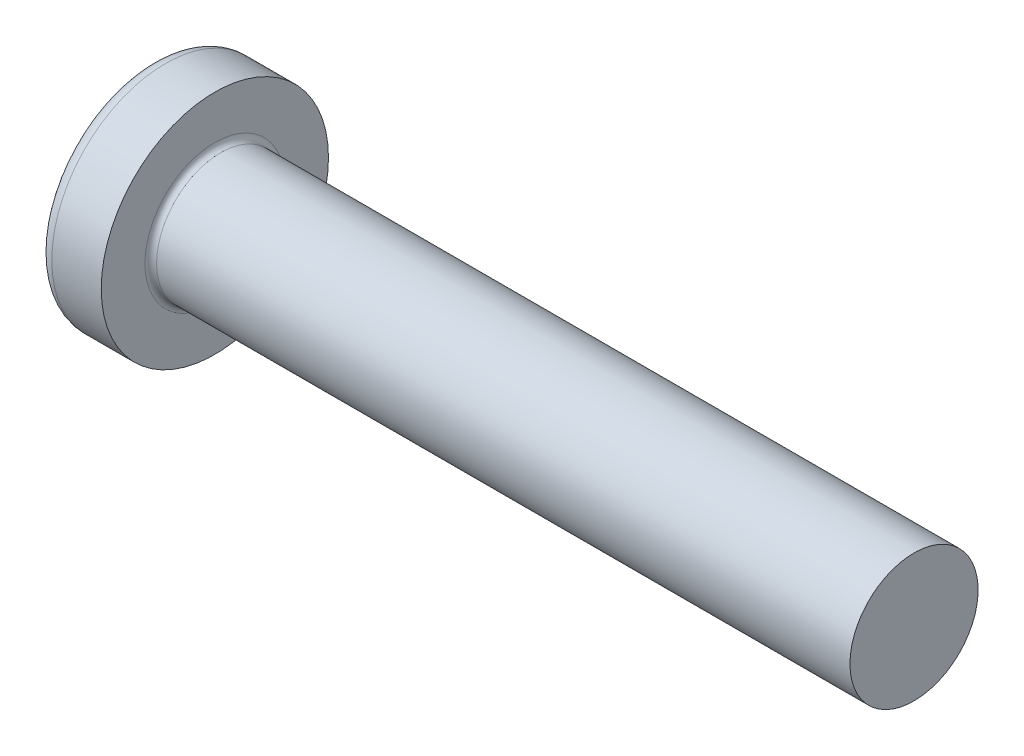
ISO-10303-21;
HEADER;
FILE_DESCRIPTION(('STEP AP214'),'2;1');
FILE_NAME('part.step','',(''),(''),'','','');
FILE_SCHEMA(('AUTOMOTIVE_DESIGN { 1 0 10303 214 1 1 1 1 }'));
ENDSEC;
DATA;
#1=APPLICATION_CONTEXT('core data for automotive mechanical design processes');
#2=APPLICATION_PROTOCOL_DEFINITION('international standard','automotive_design',2000,#1);
#3=PRODUCT_CONTEXT('',#1,'mechanical');
#4=PRODUCT('Part','Part','',(#3));
#5=PRODUCT_RELATED_PRODUCT_CATEGORY('part','',(#4));
#6=PRODUCT_DEFINITION_FORMATION('','',#4);
#7=PRODUCT_DEFINITION_CONTEXT('part definition',#1,'design');
#8=PRODUCT_DEFINITION('design','',#6,#7);
#9=PRODUCT_DEFINITION_SHAPE('','',#8);
#10=(LENGTH_UNIT() NAMED_UNIT(*) SI_UNIT(.MILLI.,.METRE.));
#11=(NAMED_UNIT(*) PLANE_ANGLE_UNIT() SI_UNIT($,.RADIAN.));
#12=(NAMED_UNIT(*) SI_UNIT($,.STERADIAN.) SOLID_ANGLE_UNIT());
#13=UNCERTAINTY_MEASURE_WITH_UNIT(LENGTH_MEASURE(1.E-05),#10,'distance_accuracy_value','');
#14=(GEOMETRIC_REPRESENTATION_CONTEXT(3) GLOBAL_UNCERTAINTY_ASSIGNED_CONTEXT((#13)) GLOBAL_UNIT_ASSIGNED_CONTEXT((#10,
#11,#12)) REPRESENTATION_CONTEXT('',''));
#15=CARTESIAN_POINT('',(0.,0.,0.));
#16=DIRECTION('',(0.,0.,1.));
#17=DIRECTION('',(1.,0.,0.));
#18=AXIS2_PLACEMENT_3D('',#15,#16,#17);
#19=CARTESIAN_POINT('',(1.2,0.601702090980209,-0.3));
#20=DIRECTION('',(-1.,0.,0.));
#21=DIRECTION('',(0.,0.,1.));
#22=AXIS2_PLACEMENT_3D('',#19,#20,#21);
#23=PLANE('',#22);
#24=DIRECTION('',(0.,0.,-1.));
#25=VECTOR('',#24,1.);
#26=CARTESIAN_POINT('',(1.2,0.299999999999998,0.60170209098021));
#27=LINE('',#26,#25);
#28=CARTESIAN_POINT('',(1.2,0.300000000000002,-0.601702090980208));
#29=VERTEX_POINT('',#28);
#30=CARTESIAN_POINT('',(1.19999999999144,0.300000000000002,-0.468119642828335));
#31=VERTEX_POINT('',#30);
#32=EDGE_CURVE('E269',#29,#31,#27,.F.);
#33=ORIENTED_EDGE('',*,*,#32,.F.);
#34=DIRECTION('',(0.,1.,0.));
#35=VECTOR('',#34,1.);
#36=CARTESIAN_POINT('',(1.2,0.300000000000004,-0.601702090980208));
#37=LINE('',#36,#35);
#38=CARTESIAN_POINT('',(1.2,-0.299999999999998,-0.60170209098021));
#39=VERTEX_POINT('',#38);
#40=EDGE_CURVE('E274',#29,#39,#37,.F.);
#41=ORIENTED_EDGE('',*,*,#40,.T.);
#42=DIRECTION('',(0.,0.,1.));
#43=VECTOR('',#42,1.);
#44=CARTESIAN_POINT('',(1.2,-0.299999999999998,-0.601702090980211));
#45=LINE('',#44,#43);
#46=CARTESIAN_POINT('',(1.19999999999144,-0.299999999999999,-0.468119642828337));
#47=VERTEX_POINT('',#46);
#48=EDGE_CURVE('E321',#47,#39,#45,.F.);
#49=ORIENTED_EDGE('',*,*,#48,.F.);
#50=CARTESIAN_POINT('',(1.19999999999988,0.,0.));
#51=DIRECTION('',(-1.,0.,0.));
#52=DIRECTION('',(0.,0.,1.));
#53=AXIS2_PLACEMENT_3D('',#50,#51,#52);
#54=CIRCLE('',#53,0.556000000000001);
#55=EDGE_CURVE('E543',#47,#31,#54,.F.);
#56=ORIENTED_EDGE('',*,*,#55,.T.);
#57=EDGE_LOOP('',(#33,#41,#49,#56));
#58=FACE_BOUND('',#57,.T.);
#59=ADVANCED_FACE('F16',(#58),#23,.T.);
#60=CARTESIAN_POINT('',(1.2,0.601702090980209,-0.3));
#61=DIRECTION('',(-1.,0.,0.));
#62=DIRECTION('',(0.,0.,1.));
#63=AXIS2_PLACEMENT_3D('',#60,#61,#62);
#64=PLANE('',#63);
#65=DIRECTION('',(0.,1.,0.));
#66=VECTOR('',#65,1.);
#67=CARTESIAN_POINT('',(1.2,-0.60170209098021,0.3));
#68=LINE('',#67,#66);
#69=CARTESIAN_POINT('',(1.2,0.601702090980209,0.3));
#70=VERTEX_POINT('',#69);
#71=CARTESIAN_POINT('',(1.19999999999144,0.468119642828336,0.3));
#72=VERTEX_POINT('',#71);
#73=EDGE_CURVE('E139',#70,#72,#68,.F.);
#74=ORIENTED_EDGE('',*,*,#73,.F.);
#75=DIRECTION('',(0.,0.,1.));
#76=VECTOR('',#75,1.);
#77=CARTESIAN_POINT('',(1.2,0.601702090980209,0.3));
#78=LINE('',#77,#76);
#79=CARTESIAN_POINT('',(1.2,0.601702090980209,-0.3));
#80=VERTEX_POINT('',#79);
#81=EDGE_CURVE('E262',#70,#80,#78,.F.);
#82=ORIENTED_EDGE('',*,*,#81,.T.);
#83=DIRECTION('',(0.,1.,0.));
#84=VECTOR('',#83,1.);
#85=CARTESIAN_POINT('',(1.2,0.601702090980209,-0.3));
#86=LINE('',#85,#84);
#87=CARTESIAN_POINT('',(1.19999999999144,0.468119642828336,-0.3));
#88=VERTEX_POINT('',#87);
#89=EDGE_CURVE('E142',#88,#80,#86,.T.);
#90=ORIENTED_EDGE('',*,*,#89,.F.);
#91=CARTESIAN_POINT('',(1.19999999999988,0.,0.));
#92=DIRECTION('',(-1.,0.,0.));
#93=DIRECTION('',(0.,0.,1.));
#94=AXIS2_PLACEMENT_3D('',#91,#92,#93);
#95=CIRCLE('',#94,0.556000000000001);
#96=EDGE_CURVE('E136',#88,#72,#95,.F.);
#97=ORIENTED_EDGE('',*,*,#96,.T.);
#98=EDGE_LOOP('',(#74,#82,#90,#97));
#99=FACE_BOUND('',#98,.T.);
#100=ADVANCED_FACE('F138',(#99),#64,.T.);
#101=CARTESIAN_POINT('',(1.2,0.601702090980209,-0.3));
#102=DIRECTION('',(-1.,0.,0.));
#103=DIRECTION('',(0.,0.,1.));
#104=AXIS2_PLACEMENT_3D('',#101,#102,#103);
#105=PLANE('',#104);
#106=DIRECTION('',(0.,0.,1.));
#107=VECTOR('',#106,1.);
#108=CARTESIAN_POINT('',(1.2,-0.299999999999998,-0.601702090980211));
#109=LINE('',#108,#107);
#110=CARTESIAN_POINT('',(1.2,-0.300000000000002,0.601702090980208));
#111=VERTEX_POINT('',#110);
#112=CARTESIAN_POINT('',(1.19999999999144,-0.300000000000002,0.468119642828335));
#113=VERTEX_POINT('',#112);
#114=EDGE_CURVE('E250',#111,#113,#109,.F.);
#115=ORIENTED_EDGE('',*,*,#114,.F.);
#116=DIRECTION('',(0.,1.,0.));
#117=VECTOR('',#116,1.);
#118=CARTESIAN_POINT('',(1.2,-0.300000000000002,0.601702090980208));
#119=LINE('',#118,#117);
#120=CARTESIAN_POINT('',(1.2,0.299999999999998,0.60170209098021));
#121=VERTEX_POINT('',#120);
#122=EDGE_CURVE('E255',#111,#121,#119,.T.);
#123=ORIENTED_EDGE('',*,*,#122,.T.);
#124=DIRECTION('',(0.,0.,-1.));
#125=VECTOR('',#124,1.);
#126=CARTESIAN_POINT('',(1.2,0.299999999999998,0.60170209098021));
#127=LINE('',#126,#125);
#128=CARTESIAN_POINT('',(1.19999999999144,0.299999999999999,0.468119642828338));
#129=VERTEX_POINT('',#128);
#130=EDGE_CURVE('E299',#129,#121,#127,.F.);
#131=ORIENTED_EDGE('',*,*,#130,.F.);
#132=CARTESIAN_POINT('',(1.19999999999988,0.,0.));
#133=DIRECTION('',(-1.,0.,0.));
#134=DIRECTION('',(0.,0.,1.));
#135=AXIS2_PLACEMENT_3D('',#132,#133,#134);
#136=CIRCLE('',#135,0.556000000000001);
#137=EDGE_CURVE('E148',#129,#113,#136,.F.);
#138=ORIENTED_EDGE('',*,*,#137,.T.);
#139=EDGE_LOOP('',(#115,#123,#131,#138));
#140=FACE_BOUND('',#139,.T.);
#141=ADVANCED_FACE('F558',(#140),#105,.T.);
#142=CARTESIAN_POINT('',(1.20000000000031,0.,0.));
#143=DIRECTION('',(-1.,0.,0.));
#144=DIRECTION('',(0.,0.,1.));
#145=AXIS2_PLACEMENT_3D('',#142,#143,#144);
#146=CONICAL_SURFACE('',#145,0.555999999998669,1.25663706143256);
#147=CARTESIAN_POINT('',(1.38065535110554,0.,0.));
#148=VERTEX_POINT('',#147);
#149=VERTEX_LOOP('',#148);
#150=FACE_BOUND('',#149,.T.);
#151=CARTESIAN_POINT('',(1.19999999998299,0.,0.));
#152=DIRECTION('',(-1.,0.,0.));
#153=DIRECTION('',(0.,0.,1.));
#154=AXIS2_PLACEMENT_3D('',#151,#152,#153);
#155=CIRCLE('',#154,0.55600000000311);
#156=EDGE_CURVE('E268',#88,#31,#155,.T.);
#157=ORIENTED_EDGE('',*,*,#156,.T.);
#158=ORIENTED_EDGE('',*,*,#55,.F.);
#159=CARTESIAN_POINT('',(1.19999999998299,0.,0.));
#160=DIRECTION('',(-1.,0.,0.));
#161=DIRECTION('',(0.,0.,1.));
#162=AXIS2_PLACEMENT_3D('',#159,#160,#161);
#163=CIRCLE('',#162,0.55600000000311);
#164=CARTESIAN_POINT('',(1.19999999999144,-0.468119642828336,-0.300000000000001));
#165=VERTEX_POINT('',#164);
#166=EDGE_CURVE('E329',#47,#165,#163,.T.);
#167=ORIENTED_EDGE('',*,*,#166,.T.);
#168=CARTESIAN_POINT('',(1.19999999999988,0.,0.));
#169=DIRECTION('',(-1.,0.,0.));
#170=DIRECTION('',(0.,0.,1.));
#171=AXIS2_PLACEMENT_3D('',#168,#169,#170);
#172=CIRCLE('',#171,0.556000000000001);
#173=CARTESIAN_POINT('',(1.19999999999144,-0.468119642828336,0.3));
#174=VERTEX_POINT('',#173);
#175=EDGE_CURVE('E289',#174,#165,#172,.F.);
#176=ORIENTED_EDGE('',*,*,#175,.F.);
#177=CARTESIAN_POINT('',(1.19999999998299,0.,0.));
#178=DIRECTION('',(-1.,0.,0.));
#179=DIRECTION('',(0.,0.,1.));
#180=AXIS2_PLACEMENT_3D('',#177,#178,#179);
#181=CIRCLE('',#180,0.55600000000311);
#182=EDGE_CURVE('E249',#174,#113,#181,.T.);
#183=ORIENTED_EDGE('',*,*,#182,.T.);
#184=ORIENTED_EDGE('',*,*,#137,.F.);
#185=CARTESIAN_POINT('',(1.19999999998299,0.,0.));
#186=DIRECTION('',(-1.,0.,0.));
#187=DIRECTION('',(0.,0.,1.));
#188=AXIS2_PLACEMENT_3D('',#185,#186,#187);
#189=CIRCLE('',#188,0.55600000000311);
#190=EDGE_CURVE('E161',#129,#72,#189,.T.);
#191=ORIENTED_EDGE('',*,*,#190,.T.);
#192=ORIENTED_EDGE('',*,*,#96,.F.);
#193=EDGE_LOOP('',(#157,#158,#167,#176,#183,#184,#191,#192));
#194=FACE_BOUND('',#193,.T.);
#195=ADVANCED_FACE('F162',(#150,#194),#146,.F.);
#196=CARTESIAN_POINT('',(1.2,0.601702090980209,-0.3));
#197=DIRECTION('',(-1.,0.,0.));
#198=DIRECTION('',(0.,0.,1.));
#199=AXIS2_PLACEMENT_3D('',#196,#197,#198);
#200=PLANE('',#199);
#201=DIRECTION('',(0.,1.,0.));
#202=VECTOR('',#201,1.);
#203=CARTESIAN_POINT('',(1.2,0.601702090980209,-0.3));
#204=LINE('',#203,#202);
#205=CARTESIAN_POINT('',(1.2,-0.601702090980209,-0.3));
#206=VERTEX_POINT('',#205);
#207=EDGE_CURVE('E285',#206,#165,#204,.T.);
#208=ORIENTED_EDGE('',*,*,#207,.F.);
#209=DIRECTION('',(0.,0.,1.));
#210=VECTOR('',#209,1.);
#211=CARTESIAN_POINT('',(1.2,-0.601702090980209,-0.3));
#212=LINE('',#211,#210);
#213=CARTESIAN_POINT('',(1.2,-0.601702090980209,0.3));
#214=VERTEX_POINT('',#213);
#215=EDGE_CURVE('E237',#206,#214,#212,.T.);
#216=ORIENTED_EDGE('',*,*,#215,.T.);
#217=DIRECTION('',(0.,1.,0.));
#218=VECTOR('',#217,1.);
#219=CARTESIAN_POINT('',(1.2,-0.60170209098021,0.3));
#220=LINE('',#219,#218);
#221=EDGE_CURVE('E243',#174,#214,#220,.F.);
#222=ORIENTED_EDGE('',*,*,#221,.F.);
#223=ORIENTED_EDGE('',*,*,#175,.T.);
#224=EDGE_LOOP('',(#208,#216,#222,#223));
#225=FACE_BOUND('',#224,.T.);
#226=ADVANCED_FACE('F547',(#225),#200,.T.);
#227=CARTESIAN_POINT('',(1.2,0.601702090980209,-0.3));
#228=DIRECTION('',(0.,0.,1.));
#229=DIRECTION('',(1.,0.,0.));
#230=AXIS2_PLACEMENT_3D('',#227,#228,#229);
#231=PLANE('',#230);
#232=CARTESIAN_POINT('',(0.170303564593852,-1.1150897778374,-0.300000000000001));
#233=CARTESIAN_POINT('',(0.143844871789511,-1.02418894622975,-0.300000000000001));
#234=CARTESIAN_POINT('',(0.120668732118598,-0.932580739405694,-0.300000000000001));
#235=CARTESIAN_POINT('',(0.0808815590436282,-0.747949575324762,-0.299999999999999));
#236=CARTESIAN_POINT('',(0.0642705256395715,-0.654926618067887,-0.299999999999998));
#237=CARTESIAN_POINT('',(0.050942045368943,-0.561196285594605,-0.299999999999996));
#238=B_SPLINE_CURVE_WITH_KNOTS('',3,(#232,#233,#234,#235,#236,#237),.UNSPECIFIED.,.F.,.F.,(4,2,
4),(0.,0.283483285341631,0.566966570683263),.UNSPECIFIED.);
#239=CARTESIAN_POINT('',(0.170303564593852,-1.1150897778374,-0.3));
#240=VERTEX_POINT('',#239);
#241=CARTESIAN_POINT('',(0.0509420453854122,-0.561196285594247,-0.3));
#242=VERTEX_POINT('',#241);
#243=EDGE_CURVE('E236',#240,#242,#238,.T.);
#244=ORIENTED_EDGE('',*,*,#243,.F.);
#245=DIRECTION('',(0.89493436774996,0.446197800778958,0.));
#246=VECTOR('',#245,1.);
#247=CARTESIAN_POINT('',(0.,-1.2,-0.3));
#248=LINE('',#247,#246);
#249=EDGE_CURVE('E240',#240,#206,#248,.T.);
#250=ORIENTED_EDGE('',*,*,#249,.T.);
#251=ORIENTED_EDGE('',*,*,#207,.T.);
#252=CARTESIAN_POINT('',(1.19999999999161,-0.468119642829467,-0.3));
#253=CARTESIAN_POINT('',(1.00851907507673,-0.483987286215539,-0.3));
#254=CARTESIAN_POINT('',(0.817023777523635,-0.499677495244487,-0.3));
#255=CARTESIAN_POINT('',(0.434004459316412,-0.530703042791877,-0.3));
#256=CARTESIAN_POINT('',(0.242480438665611,-0.546038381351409,-0.3));
#257=CARTESIAN_POINT('',(0.0509420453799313,-0.561196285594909,-0.3));
#258=B_SPLINE_CURVE_WITH_KNOTS('',3,(#252,#253,#254,#255,#256,#257),.UNSPECIFIED.,.F.,.F.,(4,2,
4),(0.,0.576411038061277,1.15282200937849),.UNSPECIFIED.);
#259=EDGE_CURVE('E288',#165,#242,#258,.T.);
#260=ORIENTED_EDGE('',*,*,#259,.T.);
#261=EDGE_LOOP('',(#244,#250,#251,#260));
#262=FACE_BOUND('',#261,.T.);
#263=ADVANCED_FACE('F469',(#262),#231,.T.);
#264=CARTESIAN_POINT('',(0.0509420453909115,0.,0.));
#265=DIRECTION('',(-1.,0.,0.));
#266=DIRECTION('',(0.,0.,1.));
#267=AXIS2_PLACEMENT_3D('',#264,#265,#266);
#268=CONICAL_SURFACE('',#267,0.636349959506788,0.0698131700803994);
#269=CARTESIAN_POINT('',(0.0509420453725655,-0.299999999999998,-0.561196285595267));
#270=CARTESIAN_POINT('',(0.242480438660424,-0.299999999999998,-0.546038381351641));
#271=CARTESIAN_POINT('',(0.434004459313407,-0.299999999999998,-0.530703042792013));
#272=CARTESIAN_POINT('',(0.817023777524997,-0.299999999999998,-0.499677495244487));
#273=CARTESIAN_POINT('',(1.00851907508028,-0.299999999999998,-0.4839872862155));
#274=CARTESIAN_POINT('',(1.19999999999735,-0.299999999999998,-0.468119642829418));
#275=B_SPLINE_CURVE_WITH_KNOTS('',3,(#269,#270,#271,#272,#273,#274),.UNSPECIFIED.,.F.,.F.,(4,2,
4),(0.,0.576410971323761,1.15282200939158),.UNSPECIFIED.);
#276=CARTESIAN_POINT('',(0.0509420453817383,-0.299999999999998,-0.561196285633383));
#277=VERTEX_POINT('',#276);
#278=EDGE_CURVE('E326',#277,#47,#275,.T.);
#279=ORIENTED_EDGE('',*,*,#278,.F.);
#280=CARTESIAN_POINT('',(0.0509420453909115,0.,0.));
#281=DIRECTION('',(-1.,0.,0.));
#282=DIRECTION('',(0.,0.,1.));
#283=AXIS2_PLACEMENT_3D('',#280,#281,#282);
#284=CIRCLE('',#283,0.636349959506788);
#285=EDGE_CURVE('E461',#242,#277,#284,.F.);
#286=ORIENTED_EDGE('',*,*,#285,.F.);
#287=ORIENTED_EDGE('',*,*,#259,.F.);
#288=ORIENTED_EDGE('',*,*,#166,.F.);
#289=EDGE_LOOP('',(#279,#286,#287,#288));
#290=FACE_BOUND('',#289,.T.);
#291=ADVANCED_FACE('F442',(#290),#268,.F.);
#292=CARTESIAN_POINT('',(1.2,-0.299999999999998,-0.601702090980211));
#293=DIRECTION('',(0.,1.,0.));
#294=DIRECTION('',(0.,0.,1.));
#295=AXIS2_PLACEMENT_3D('',#292,#293,#294);
#296=PLANE('',#295);
#297=ORIENTED_EDGE('',*,*,#48,.T.);
#298=DIRECTION('',(-0.89493436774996,0.,-0.446197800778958));
#299=VECTOR('',#298,1.);
#300=CARTESIAN_POINT('',(0.,-0.299999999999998,-1.2));
#301=LINE('',#300,#299);
#302=CARTESIAN_POINT('',(0.170303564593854,-0.299999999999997,-1.1150897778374));
#303=VERTEX_POINT('',#302);
#304=EDGE_CURVE('E272',#39,#303,#301,.T.);
#305=ORIENTED_EDGE('',*,*,#304,.T.);
#306=CARTESIAN_POINT('',(4.,-0.299999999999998,0.));
#307=DIRECTION('',(0.,1.,0.));
#308=DIRECTION('',(0.,0.,1.));
#309=AXIS2_PLACEMENT_3D('',#306,#307,#308);
#310=CIRCLE('',#309,3.98873413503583);
#311=EDGE_CURVE('E459',#277,#303,#310,.F.);
#312=ORIENTED_EDGE('',*,*,#311,.F.);
#313=ORIENTED_EDGE('',*,*,#278,.T.);
#314=EDGE_LOOP('',(#297,#305,#312,#313));
#315=FACE_BOUND('',#314,.T.);
#316=ADVANCED_FACE('F444',(#315),#296,.T.);
#317=CARTESIAN_POINT('',(0.,0.300000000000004,-1.2));
#318=DIRECTION('',(0.446197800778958,0.,-0.89493436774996));
#319=DIRECTION('',(-0.89493436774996,0.,-0.446197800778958));
#320=AXIS2_PLACEMENT_3D('',#317,#318,#319);
#321=PLANE('',#320);
#322=ORIENTED_EDGE('',*,*,#40,.F.);
#323=DIRECTION('',(0.89493436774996,0.,0.446197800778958));
#324=VECTOR('',#323,1.);
#325=CARTESIAN_POINT('',(0.170303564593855,0.300000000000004,-1.1150897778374));
#326=LINE('',#325,#324);
#327=CARTESIAN_POINT('',(0.170303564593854,0.300000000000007,-1.1150897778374));
#328=VERTEX_POINT('',#327);
#329=EDGE_CURVE('E265',#328,#29,#326,.T.);
#330=ORIENTED_EDGE('',*,*,#329,.F.);
#331=CARTESIAN_POINT('',(0.170303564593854,-0.299999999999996,-1.1150897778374));
#332=CARTESIAN_POINT('',(0.163473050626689,-0.199999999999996,-1.11849534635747));
#333=CARTESIAN_POINT('',(0.160057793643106,-0.0999999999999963,-1.12019813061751));
#334=CARTESIAN_POINT('',(0.160057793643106,0.100000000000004,-1.12019813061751));
#335=CARTESIAN_POINT('',(0.163473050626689,0.200000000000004,-1.11849534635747));
#336=CARTESIAN_POINT('',(0.170303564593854,0.300000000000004,-1.1150897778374));
#337=B_SPLINE_CURVE_WITH_KNOTS('',3,(#331,#332,#333,#334,#335,#336),.UNSPECIFIED.,.F.,.F.,(4,2,
4),(0.,0.300218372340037,0.600436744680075),.UNSPECIFIED.);
#338=EDGE_CURVE('E453',#303,#328,#337,.T.);
#339=ORIENTED_EDGE('',*,*,#338,.F.);
#340=ORIENTED_EDGE('',*,*,#304,.F.);
#341=EDGE_LOOP('',(#322,#330,#339,#340));
#342=FACE_BOUND('',#341,.T.);
#343=ADVANCED_FACE('F447',(#342),#321,.F.);
#344=CARTESIAN_POINT('',(1.2,0.299999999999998,0.60170209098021));
#345=DIRECTION('',(0.,-1.,0.));
#346=DIRECTION('',(0.,0.,-1.));
#347=AXIS2_PLACEMENT_3D('',#344,#345,#346);
#348=PLANE('',#347);
#349=CARTESIAN_POINT('',(4.,0.300000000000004,0.));
#350=DIRECTION('',(0.,1.,0.));
#351=DIRECTION('',(0.,0.,1.));
#352=AXIS2_PLACEMENT_3D('',#349,#350,#351);
#353=CIRCLE('',#352,3.98873413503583);
#354=CARTESIAN_POINT('',(0.0509420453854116,0.300000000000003,-0.56119628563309));
#355=VERTEX_POINT('',#354);
#356=EDGE_CURVE('E407',#328,#355,#353,.T.);
#357=ORIENTED_EDGE('',*,*,#356,.F.);
#358=ORIENTED_EDGE('',*,*,#329,.T.);
#359=ORIENTED_EDGE('',*,*,#32,.T.);
#360=CARTESIAN_POINT('',(1.1999999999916,0.300000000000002,-0.468119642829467));
#361=CARTESIAN_POINT('',(1.00851907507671,0.300000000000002,-0.483987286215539));
#362=CARTESIAN_POINT('',(0.817023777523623,0.300000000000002,-0.499677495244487));
#363=CARTESIAN_POINT('',(0.434004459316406,0.300000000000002,-0.530703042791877));
#364=CARTESIAN_POINT('',(0.242480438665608,0.300000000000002,-0.546038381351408));
#365=CARTESIAN_POINT('',(0.0509420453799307,0.300000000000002,-0.561196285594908));
#366=B_SPLINE_CURVE_WITH_KNOTS('',3,(#360,#361,#362,#363,#364,#365),.UNSPECIFIED.,.F.,.F.,(4,2,
4),(0.,0.576411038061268,1.15282200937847),.UNSPECIFIED.);
#367=EDGE_CURVE('E315',#31,#355,#366,.T.);
#368=ORIENTED_EDGE('',*,*,#367,.T.);
#369=EDGE_LOOP('',(#357,#358,#359,#368));
#370=FACE_BOUND('',#369,.T.);
#371=ADVANCED_FACE('F422',(#370),#348,.T.);
#372=CARTESIAN_POINT('',(0.0509420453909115,0.,0.));
#373=DIRECTION('',(-1.,0.,0.));
#374=DIRECTION('',(0.,0.,1.));
#375=AXIS2_PLACEMENT_3D('',#372,#373,#374);
#376=CONICAL_SURFACE('',#375,0.636349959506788,0.0698131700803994);
#377=ORIENTED_EDGE('',*,*,#367,.F.);
#378=ORIENTED_EDGE('',*,*,#156,.F.);
#379=CARTESIAN_POINT('',(0.0509420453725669,0.561196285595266,-0.3));
#380=CARTESIAN_POINT('',(0.242480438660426,0.54603838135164,-0.3));
#381=CARTESIAN_POINT('',(0.434004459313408,0.530703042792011,-0.3));
#382=CARTESIAN_POINT('',(0.817023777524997,0.499677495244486,-0.3));
#383=CARTESIAN_POINT('',(1.00851907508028,0.483987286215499,-0.3));
#384=CARTESIAN_POINT('',(1.19999999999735,0.468119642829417,-0.3));
#385=B_SPLINE_CURVE_WITH_KNOTS('',3,(#379,#380,#381,#382,#383,#384),.UNSPECIFIED.,.F.,.F.,(4,2,
4),(0.,0.57641097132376,1.15282200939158),.UNSPECIFIED.);
#386=CARTESIAN_POINT('',(0.0509420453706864,0.561196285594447,-0.3));
#387=VERTEX_POINT('',#386);
#388=EDGE_CURVE('E186',#387,#88,#385,.T.);
#389=ORIENTED_EDGE('',*,*,#388,.F.);
#390=CARTESIAN_POINT('',(0.0509420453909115,0.,0.));
#391=DIRECTION('',(-1.,0.,0.));
#392=DIRECTION('',(0.,0.,1.));
#393=AXIS2_PLACEMENT_3D('',#390,#391,#392);
#394=CIRCLE('',#393,0.636349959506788);
#395=EDGE_CURVE('E406',#355,#387,#394,.F.);
#396=ORIENTED_EDGE('',*,*,#395,.F.);
#397=EDGE_LOOP('',(#377,#378,#389,#396));
#398=FACE_BOUND('',#397,.T.);
#399=ADVANCED_FACE('F416',(#398),#376,.F.);
#400=CARTESIAN_POINT('',(1.2,0.601702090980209,-0.3));
#401=DIRECTION('',(0.,0.,1.));
#402=DIRECTION('',(1.,0.,0.));
#403=AXIS2_PLACEMENT_3D('',#400,#401,#402);
#404=PLANE('',#403);
#405=ORIENTED_EDGE('',*,*,#89,.T.);
#406=DIRECTION('',(-0.89493436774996,0.446197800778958,0.));
#407=VECTOR('',#406,1.);
#408=CARTESIAN_POINT('',(1.2,0.601702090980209,-0.3));
#409=LINE('',#408,#407);
#410=CARTESIAN_POINT('',(0.170303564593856,1.1150897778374,-0.3));
#411=VERTEX_POINT('',#410);
#412=EDGE_CURVE('E158',#80,#411,#409,.T.);
#413=ORIENTED_EDGE('',*,*,#412,.T.);
#414=CARTESIAN_POINT('',(0.0509420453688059,0.561196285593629,-0.299999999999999));
#415=CARTESIAN_POINT('',(0.0642705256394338,0.65492661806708,-0.299999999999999));
#416=CARTESIAN_POINT('',(0.0808815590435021,0.747949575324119,-0.3));
#417=CARTESIAN_POINT('',(0.120668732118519,0.932580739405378,-0.3));
#418=CARTESIAN_POINT('',(0.143844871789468,1.0241889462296,-0.300000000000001));
#419=CARTESIAN_POINT('',(0.170303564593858,1.1150897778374,-0.300000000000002));
#420=B_SPLINE_CURVE_WITH_KNOTS('',3,(#414,#415,#416,#417,#418,#419),.UNSPECIFIED.,.F.,.F.,(4,2,
4),(0.,0.283483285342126,0.566966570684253),.UNSPECIFIED.);
#421=EDGE_CURVE('E403',#387,#411,#420,.T.);
#422=ORIENTED_EDGE('',*,*,#421,.F.);
#423=ORIENTED_EDGE('',*,*,#388,.T.);
#424=EDGE_LOOP('',(#405,#413,#422,#423));
#425=FACE_BOUND('',#424,.T.);
#426=ADVANCED_FACE('F413',(#425),#404,.T.);
#427=CARTESIAN_POINT('',(1.2,0.601702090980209,0.3));
#428=DIRECTION('',(0.446197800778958,0.89493436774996,0.));
#429=DIRECTION('',(-0.89493436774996,0.446197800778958,0.));
#430=AXIS2_PLACEMENT_3D('',#427,#428,#429);
#431=PLANE('',#430);
#432=ORIENTED_EDGE('',*,*,#81,.F.);
#433=DIRECTION('',(0.89493436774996,-0.446197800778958,0.));
#434=VECTOR('',#433,1.);
#435=CARTESIAN_POINT('',(0.170303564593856,1.1150897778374,0.3));
#436=LINE('',#435,#434);
#437=CARTESIAN_POINT('',(0.170303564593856,1.1150897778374,0.3));
#438=VERTEX_POINT('',#437);
#439=EDGE_CURVE('E157',#438,#70,#436,.T.);
#440=ORIENTED_EDGE('',*,*,#439,.F.);
#441=CARTESIAN_POINT('',(0.170303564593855,1.1150897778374,-0.3));
#442=CARTESIAN_POINT('',(0.163473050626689,1.11849534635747,-0.2));
#443=CARTESIAN_POINT('',(0.160057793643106,1.1201981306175,-0.1));
#444=CARTESIAN_POINT('',(0.160057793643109,1.12019813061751,0.100000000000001));
#445=CARTESIAN_POINT('',(0.163473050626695,1.11849534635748,0.200000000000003));
#446=CARTESIAN_POINT('',(0.170303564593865,1.11508977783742,0.300000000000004));
#447=B_SPLINE_CURVE_WITH_KNOTS('',3,(#441,#442,#443,#444,#445,#446),.UNSPECIFIED.,.F.,.F.,(4,2,
4),(0.,0.300218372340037,0.600436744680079),.UNSPECIFIED.);
#448=EDGE_CURVE('E208',#411,#438,#447,.T.);
#449=ORIENTED_EDGE('',*,*,#448,.F.);
#450=ORIENTED_EDGE('',*,*,#412,.F.);
#451=EDGE_LOOP('',(#432,#440,#449,#450));
#452=FACE_BOUND('',#451,.T.);
#453=ADVANCED_FACE('F197',(#452),#431,.F.);
#454=CARTESIAN_POINT('',(1.2,-0.60170209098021,0.3));
#455=DIRECTION('',(0.,0.,-1.));
#456=DIRECTION('',(-1.,0.,0.));
#457=AXIS2_PLACEMENT_3D('',#454,#455,#456);
#458=PLANE('',#457);
#459=CARTESIAN_POINT('',(0.170303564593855,1.1150897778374,0.299999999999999));
#460=CARTESIAN_POINT('',(0.143844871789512,1.02418894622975,0.3));
#461=CARTESIAN_POINT('',(0.120668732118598,0.932580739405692,0.300000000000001));
#462=CARTESIAN_POINT('',(0.080881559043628,0.747949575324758,0.299999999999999));
#463=CARTESIAN_POINT('',(0.0642705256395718,0.654926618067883,0.299999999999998));
#464=CARTESIAN_POINT('',(0.0509420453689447,0.561196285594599,0.299999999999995));
#465=B_SPLINE_CURVE_WITH_KNOTS('',3,(#459,#460,#461,#462,#463,#464),.UNSPECIFIED.,.F.,.F.,(4,2,
4),(0.,0.283483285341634,0.566966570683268),.UNSPECIFIED.);
#466=CARTESIAN_POINT('',(0.0509420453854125,0.561196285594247,0.3));
#467=VERTEX_POINT('',#466);
#468=EDGE_CURVE('E201',#438,#467,#465,.T.);
#469=ORIENTED_EDGE('',*,*,#468,.F.);
#470=ORIENTED_EDGE('',*,*,#439,.T.);
#471=ORIENTED_EDGE('',*,*,#73,.T.);
#472=CARTESIAN_POINT('',(1.19999999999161,0.468119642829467,0.3));
#473=CARTESIAN_POINT('',(1.00851907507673,0.483987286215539,0.3));
#474=CARTESIAN_POINT('',(0.817023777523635,0.499677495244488,0.3));
#475=CARTESIAN_POINT('',(0.434004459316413,0.530703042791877,0.3));
#476=CARTESIAN_POINT('',(0.242480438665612,0.546038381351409,0.3));
#477=CARTESIAN_POINT('',(0.0509420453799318,0.561196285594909,0.3));
#478=B_SPLINE_CURVE_WITH_KNOTS('',3,(#472,#473,#474,#475,#476,#477),.UNSPECIFIED.,.F.,.F.,(4,2,
4),(0.,0.576411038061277,1.15282200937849),.UNSPECIFIED.);
#479=EDGE_CURVE('E155',#72,#467,#478,.T.);
#480=ORIENTED_EDGE('',*,*,#479,.T.);
#481=EDGE_LOOP('',(#469,#470,#471,#480));
#482=FACE_BOUND('',#481,.T.);
#483=ADVANCED_FACE('F153',(#482),#458,.T.);
#484=CARTESIAN_POINT('',(0.0509420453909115,0.,0.));
#485=DIRECTION('',(-1.,0.,0.));
#486=DIRECTION('',(0.,0.,1.));
#487=AXIS2_PLACEMENT_3D('',#484,#485,#486);
#488=CONICAL_SURFACE('',#487,0.636349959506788,0.0698131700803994);
#489=CARTESIAN_POINT('',(0.0509420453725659,0.299999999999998,0.561196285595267));
#490=CARTESIAN_POINT('',(0.242480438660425,0.299999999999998,0.546038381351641));
#491=CARTESIAN_POINT('',(0.434004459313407,0.299999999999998,0.530703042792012));
#492=CARTESIAN_POINT('',(0.817023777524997,0.299999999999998,0.499677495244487));
#493=CARTESIAN_POINT('',(1.00851907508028,0.299999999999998,0.4839872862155));
#494=CARTESIAN_POINT('',(1.19999999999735,0.299999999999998,0.468119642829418));
#495=B_SPLINE_CURVE_WITH_KNOTS('',3,(#489,#490,#491,#492,#493,#494),.UNSPECIFIED.,.F.,.F.,(4,2,
4),(0.,0.576410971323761,1.15282200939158),.UNSPECIFIED.);
#496=CARTESIAN_POINT('',(0.0509420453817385,0.299999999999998,0.561196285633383));
#497=VERTEX_POINT('',#496);
#498=EDGE_CURVE('E166',#497,#129,#495,.T.);
#499=ORIENTED_EDGE('',*,*,#498,.F.);
#500=CARTESIAN_POINT('',(0.0509420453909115,0.,0.));
#501=DIRECTION('',(-1.,0.,0.));
#502=DIRECTION('',(0.,0.,1.));
#503=AXIS2_PLACEMENT_3D('',#500,#501,#502);
#504=CIRCLE('',#503,0.636349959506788);
#505=EDGE_CURVE('E170',#467,#497,#504,.F.);
#506=ORIENTED_EDGE('',*,*,#505,.F.);
#507=ORIENTED_EDGE('',*,*,#479,.F.);
#508=ORIENTED_EDGE('',*,*,#190,.F.);
#509=EDGE_LOOP('',(#499,#506,#507,#508));
#510=FACE_BOUND('',#509,.T.);
#511=ADVANCED_FACE('F168',(#510),#488,.F.);
#512=CARTESIAN_POINT('',(1.2,0.299999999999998,0.60170209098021));
#513=DIRECTION('',(0.,-1.,0.));
#514=DIRECTION('',(0.,0.,-1.));
#515=AXIS2_PLACEMENT_3D('',#512,#513,#514);
#516=PLANE('',#515);
#517=ORIENTED_EDGE('',*,*,#130,.T.);
#518=DIRECTION('',(0.89493436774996,0.,-0.446197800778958));
#519=VECTOR('',#518,1.);
#520=CARTESIAN_POINT('',(1.2,0.299999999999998,0.60170209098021));
#521=LINE('',#520,#519);
#522=CARTESIAN_POINT('',(0.170303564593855,0.299999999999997,1.1150897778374));
#523=VERTEX_POINT('',#522);
#524=EDGE_CURVE('E253',#121,#523,#521,.F.);
#525=ORIENTED_EDGE('',*,*,#524,.T.);
#526=CARTESIAN_POINT('',(4.,0.299999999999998,0.));
#527=DIRECTION('',(0.,1.,0.));
#528=DIRECTION('',(0.,0.,1.));
#529=AXIS2_PLACEMENT_3D('',#526,#527,#528);
#530=CIRCLE('',#529,3.98873413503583);
#531=EDGE_CURVE('E395',#497,#523,#530,.T.);
#532=ORIENTED_EDGE('',*,*,#531,.F.);
#533=ORIENTED_EDGE('',*,*,#498,.T.);
#534=EDGE_LOOP('',(#517,#525,#532,#533));
#535=FACE_BOUND('',#534,.T.);
#536=ADVANCED_FACE('F386',(#535),#516,.T.);
#537=CARTESIAN_POINT('',(1.2,-0.300000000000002,0.601702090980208));
#538=DIRECTION('',(0.446197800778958,0.,0.89493436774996));
#539=DIRECTION('',(0.89493436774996,0.,-0.446197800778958));
#540=AXIS2_PLACEMENT_3D('',#537,#538,#539);
#541=PLANE('',#540);
#542=ORIENTED_EDGE('',*,*,#122,.F.);
#543=DIRECTION('',(0.89493436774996,0.,-0.446197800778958));
#544=VECTOR('',#543,1.);
#545=CARTESIAN_POINT('',(0.170303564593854,-0.300000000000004,1.1150897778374));
#546=LINE('',#545,#544);
#547=CARTESIAN_POINT('',(0.170303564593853,-0.300000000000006,1.1150897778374));
#548=VERTEX_POINT('',#547);
#549=EDGE_CURVE('E246',#548,#111,#546,.T.);
#550=ORIENTED_EDGE('',*,*,#549,.F.);
#551=CARTESIAN_POINT('',(0.170303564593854,0.299999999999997,1.1150897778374));
#552=CARTESIAN_POINT('',(0.163473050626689,0.199999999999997,1.11849534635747));
#553=CARTESIAN_POINT('',(0.160057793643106,0.0999999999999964,1.12019813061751));
#554=CARTESIAN_POINT('',(0.160057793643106,-0.100000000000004,1.12019813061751));
#555=CARTESIAN_POINT('',(0.163473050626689,-0.200000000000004,1.11849534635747));
#556=CARTESIAN_POINT('',(0.170303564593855,-0.300000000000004,1.1150897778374));
#557=B_SPLINE_CURVE_WITH_KNOTS('',3,(#551,#552,#553,#554,#555,#556),.UNSPECIFIED.,.F.,.F.,(4,2,
4),(0.,0.300218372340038,0.600436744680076),.UNSPECIFIED.);
#558=EDGE_CURVE('E389',#523,#548,#557,.T.);
#559=ORIENTED_EDGE('',*,*,#558,.F.);
#560=ORIENTED_EDGE('',*,*,#524,.F.);
#561=EDGE_LOOP('',(#542,#550,#559,#560));
#562=FACE_BOUND('',#561,.T.);
#563=ADVANCED_FACE('F382',(#562),#541,.F.);
#564=CARTESIAN_POINT('',(1.2,-0.299999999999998,-0.601702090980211));
#565=DIRECTION('',(0.,1.,0.));
#566=DIRECTION('',(0.,0.,1.));
#567=AXIS2_PLACEMENT_3D('',#564,#565,#566);
#568=PLANE('',#567);
#569=CARTESIAN_POINT('',(4.,-0.300000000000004,0.));
#570=DIRECTION('',(0.,1.,0.));
#571=DIRECTION('',(0.,0.,1.));
#572=AXIS2_PLACEMENT_3D('',#569,#570,#571);
#573=CIRCLE('',#572,3.98873413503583);
#574=CARTESIAN_POINT('',(0.0509420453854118,-0.300000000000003,0.561196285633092));
#575=VERTEX_POINT('',#574);
#576=EDGE_CURVE('E394',#548,#575,#573,.F.);
#577=ORIENTED_EDGE('',*,*,#576,.F.);
#578=ORIENTED_EDGE('',*,*,#549,.T.);
#579=ORIENTED_EDGE('',*,*,#114,.T.);
#580=CARTESIAN_POINT('',(1.1999999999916,-0.300000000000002,0.468119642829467));
#581=CARTESIAN_POINT('',(1.00851907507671,-0.300000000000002,0.483987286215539));
#582=CARTESIAN_POINT('',(0.817023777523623,-0.300000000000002,0.499677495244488));
#583=CARTESIAN_POINT('',(0.434004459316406,-0.300000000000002,0.530703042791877));
#584=CARTESIAN_POINT('',(0.242480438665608,-0.300000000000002,0.546038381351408));
#585=CARTESIAN_POINT('',(0.0509420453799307,-0.300000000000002,0.561196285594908));
#586=B_SPLINE_CURVE_WITH_KNOTS('',3,(#580,#581,#582,#583,#584,#585),.UNSPECIFIED.,.F.,.F.,(4,2,
4),(0.,0.576411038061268,1.15282200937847),.UNSPECIFIED.);
#587=EDGE_CURVE('E293',#113,#575,#586,.T.);
#588=ORIENTED_EDGE('',*,*,#587,.T.);
#589=EDGE_LOOP('',(#577,#578,#579,#588));
#590=FACE_BOUND('',#589,.T.);
#591=ADVANCED_FACE('F378',(#590),#568,.T.);
#592=CARTESIAN_POINT('',(0.0509420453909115,0.,0.));
#593=DIRECTION('',(-1.,0.,0.));
#594=DIRECTION('',(0.,0.,1.));
#595=AXIS2_PLACEMENT_3D('',#592,#593,#594);
#596=CONICAL_SURFACE('',#595,0.636349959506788,0.0698131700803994);
#597=ORIENTED_EDGE('',*,*,#587,.F.);
#598=ORIENTED_EDGE('',*,*,#182,.F.);
#599=CARTESIAN_POINT('',(0.0509420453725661,-0.561196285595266,0.3));
#600=CARTESIAN_POINT('',(0.242480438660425,-0.54603838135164,0.3));
#601=CARTESIAN_POINT('',(0.434004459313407,-0.530703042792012,0.3));
#602=CARTESIAN_POINT('',(0.817023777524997,-0.499677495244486,0.3));
#603=CARTESIAN_POINT('',(1.00851907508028,-0.483987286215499,0.3));
#604=CARTESIAN_POINT('',(1.19999999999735,-0.468119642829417,0.3));
#605=B_SPLINE_CURVE_WITH_KNOTS('',3,(#599,#600,#601,#602,#603,#604),.UNSPECIFIED.,.F.,.F.,(4,2,
4),(0.,0.576410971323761,1.15282200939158),.UNSPECIFIED.);
#606=CARTESIAN_POINT('',(0.050942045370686,-0.561196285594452,0.3));
#607=VERTEX_POINT('',#606);
#608=EDGE_CURVE('E279',#607,#174,#605,.T.);
#609=ORIENTED_EDGE('',*,*,#608,.F.);
#610=CARTESIAN_POINT('',(0.0509420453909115,0.,0.));
#611=DIRECTION('',(-1.,0.,0.));
#612=DIRECTION('',(0.,0.,1.));
#613=AXIS2_PLACEMENT_3D('',#610,#611,#612);
#614=CIRCLE('',#613,0.636349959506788);
#615=EDGE_CURVE('E353',#575,#607,#614,.F.);
#616=ORIENTED_EDGE('',*,*,#615,.F.);
#617=EDGE_LOOP('',(#597,#598,#609,#616));
#618=FACE_BOUND('',#617,.T.);
#619=ADVANCED_FACE('F359',(#618),#596,.F.);
#620=CARTESIAN_POINT('',(1.2,-0.60170209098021,0.3));
#621=DIRECTION('',(0.,0.,-1.));
#622=DIRECTION('',(-1.,0.,0.));
#623=AXIS2_PLACEMENT_3D('',#620,#621,#622);
#624=PLANE('',#623);
#625=ORIENTED_EDGE('',*,*,#221,.T.);
#626=DIRECTION('',(0.89493436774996,0.446197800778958,0.));
#627=VECTOR('',#626,1.);
#628=CARTESIAN_POINT('',(0.,-1.2,0.3));
#629=LINE('',#628,#627);
#630=CARTESIAN_POINT('',(0.170303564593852,-1.1150897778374,0.3));
#631=VERTEX_POINT('',#630);
#632=EDGE_CURVE('E234',#214,#631,#629,.F.);
#633=ORIENTED_EDGE('',*,*,#632,.T.);
#634=CARTESIAN_POINT('',(0.0509420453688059,-0.561196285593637,0.300000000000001));
#635=CARTESIAN_POINT('',(0.0642705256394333,-0.654926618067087,0.3));
#636=CARTESIAN_POINT('',(0.080881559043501,-0.747949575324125,0.3));
#637=CARTESIAN_POINT('',(0.120668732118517,-0.932580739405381,0.3));
#638=CARTESIAN_POINT('',(0.143844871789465,-1.0241889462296,0.3));
#639=CARTESIAN_POINT('',(0.170303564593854,-1.11508977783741,0.300000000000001));
#640=B_SPLINE_CURVE_WITH_KNOTS('',3,(#634,#635,#636,#637,#638,#639),.UNSPECIFIED.,.F.,.F.,(4,2,
4),(0.,0.283483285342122,0.566966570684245),.UNSPECIFIED.);
#641=EDGE_CURVE('E347',#607,#631,#640,.T.);
#642=ORIENTED_EDGE('',*,*,#641,.F.);
#643=ORIENTED_EDGE('',*,*,#608,.T.);
#644=EDGE_LOOP('',(#625,#633,#642,#643));
#645=FACE_BOUND('',#644,.T.);
#646=ADVANCED_FACE('F355',(#645),#624,.T.);
#647=CARTESIAN_POINT('',(0.,-1.2,-0.3));
#648=DIRECTION('',(0.446197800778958,-0.89493436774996,0.));
#649=DIRECTION('',(0.89493436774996,0.446197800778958,0.));
#650=AXIS2_PLACEMENT_3D('',#647,#648,#649);
#651=PLANE('',#650);
#652=ORIENTED_EDGE('',*,*,#215,.F.);
#653=ORIENTED_EDGE('',*,*,#249,.F.);
#654=CARTESIAN_POINT('',(0.170303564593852,-1.1150897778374,0.3));
#655=CARTESIAN_POINT('',(0.16347305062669,-1.11849534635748,0.2));
#656=CARTESIAN_POINT('',(0.160057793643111,-1.12019813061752,0.0999999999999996));
#657=CARTESIAN_POINT('',(0.160057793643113,-1.12019813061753,-0.100000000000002));
#658=CARTESIAN_POINT('',(0.163473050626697,-1.11849534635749,-0.200000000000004));
#659=CARTESIAN_POINT('',(0.170303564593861,-1.11508977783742,-0.300000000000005));
#660=B_SPLINE_CURVE_WITH_KNOTS('',3,(#654,#655,#656,#657,#658,#659),.UNSPECIFIED.,.F.,.F.,(4,2,
4),(0.,0.300218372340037,0.60043674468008),.UNSPECIFIED.);
#661=EDGE_CURVE('E342',#631,#240,#660,.T.);
#662=ORIENTED_EDGE('',*,*,#661,.F.);
#663=ORIENTED_EDGE('',*,*,#632,.F.);
#664=EDGE_LOOP('',(#652,#653,#662,#663));
#665=FACE_BOUND('',#664,.T.);
#666=ADVANCED_FACE('F221',(#665),#651,.F.);
#667=CARTESIAN_POINT('',(4.,0.,0.));
#668=DIRECTION('',(0.,1.,0.));
#669=DIRECTION('',(1.,0.,0.));
#670=AXIS2_PLACEMENT_3D('',#667,#668,#669);
#671=SPHERICAL_SURFACE('',#670,4.);
#672=CARTESIAN_POINT('',(0.437599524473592,0.,0.));
#673=DIRECTION('',(-1.,0.,0.));
#674=DIRECTION('',(0.,0.,1.));
#675=AXIS2_PLACEMENT_3D('',#672,#673,#674);
#676=CIRCLE('',#675,1.81914893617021);
#677=CARTESIAN_POINT('',(0.437599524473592,0.,1.81914893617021));
#678=VERTEX_POINT('',#677);
#679=EDGE_CURVE('E338',#678,#678,#676,.F.);
#680=ORIENTED_EDGE('',*,*,#679,.F.);
#681=EDGE_LOOP('',(#680));
#682=FACE_BOUND('',#681,.T.);
#683=ORIENTED_EDGE('',*,*,#641,.T.);
#684=ORIENTED_EDGE('',*,*,#661,.T.);
#685=ORIENTED_EDGE('',*,*,#243,.T.);
#686=ORIENTED_EDGE('',*,*,#285,.T.);
#687=ORIENTED_EDGE('',*,*,#311,.T.);
#688=ORIENTED_EDGE('',*,*,#338,.T.);
#689=ORIENTED_EDGE('',*,*,#356,.T.);
#690=ORIENTED_EDGE('',*,*,#395,.T.);
#691=ORIENTED_EDGE('',*,*,#421,.T.);
#692=ORIENTED_EDGE('',*,*,#448,.T.);
#693=ORIENTED_EDGE('',*,*,#468,.T.);
#694=ORIENTED_EDGE('',*,*,#505,.T.);
#695=ORIENTED_EDGE('',*,*,#531,.T.);
#696=ORIENTED_EDGE('',*,*,#558,.T.);
#697=ORIENTED_EDGE('',*,*,#576,.T.);
#698=ORIENTED_EDGE('',*,*,#615,.T.);
#699=EDGE_LOOP('',(#683,#684,#685,#686,#687,#688,#689,#690,#691,#692,#693,#694,#695,#696,#697,#698));
#700=FACE_BOUND('',#699,.T.);
#701=ADVANCED_FACE('F214',(#682,#700),#671,.T.);
#702=CARTESIAN_POINT('',(0.651343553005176,0.,0.));
#703=DIRECTION('',(-1.,0.,0.));
#704=DIRECTION('',(0.,0.,1.));
#705=AXIS2_PLACEMENT_3D('',#702,#703,#704);
#706=TOROIDAL_SURFACE('',#705,1.71,0.24);
#707=ORIENTED_EDGE('',*,*,#679,.T.);
#708=EDGE_LOOP('',(#707));
#709=FACE_BOUND('',#708,.T.);
#710=CARTESIAN_POINT('',(0.651343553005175,0.,0.));
#711=DIRECTION('',(-1.,0.,0.));
#712=DIRECTION('',(0.,0.,1.));
#713=AXIS2_PLACEMENT_3D('',#710,#711,#712);
#714=CIRCLE('',#713,1.95);
#715=CARTESIAN_POINT('',(0.651343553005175,0.,1.95));
#716=VERTEX_POINT('',#715);
#717=EDGE_CURVE('E341',#716,#716,#714,.F.);
#718=ORIENTED_EDGE('',*,*,#717,.F.);
#719=EDGE_LOOP('',(#718));
#720=FACE_BOUND('',#719,.T.);
#721=ADVANCED_FACE('F220',(#709,#720),#706,.T.);
#722=CARTESIAN_POINT('',(-25.4,0.,0.));
#723=DIRECTION('',(-1.,0.,0.));
#724=DIRECTION('',(0.,0.,1.));
#725=AXIS2_PLACEMENT_3D('',#722,#723,#724);
#726=CYLINDRICAL_SURFACE('',#725,1.95);
#727=ORIENTED_EDGE('',*,*,#717,.T.);
#728=EDGE_LOOP('',(#727));
#729=FACE_BOUND('',#728,.T.);
#730=CARTESIAN_POINT('',(1.5,0.,0.));
#731=DIRECTION('',(-1.,0.,0.));
#732=DIRECTION('',(0.,0.,1.));
#733=AXIS2_PLACEMENT_3D('',#730,#731,#732);
#734=CIRCLE('',#733,1.95);
#735=CARTESIAN_POINT('',(1.5,0.,1.95));
#736=VERTEX_POINT('',#735);
#737=EDGE_CURVE('E335',#736,#736,#734,.T.);
#738=ORIENTED_EDGE('',*,*,#737,.T.);
#739=EDGE_LOOP('',(#738));
#740=FACE_BOUND('',#739,.T.);
#741=ADVANCED_FACE('F519',(#729,#740),#726,.T.);
#742=CARTESIAN_POINT('',(1.5,1.1,0.));
#743=DIRECTION('',(-1.,0.,0.));
#744=DIRECTION('',(0.,0.,1.));
#745=AXIS2_PLACEMENT_3D('',#742,#743,#744);
#746=PLANE('',#745);
#747=ORIENTED_EDGE('',*,*,#737,.F.);
#748=EDGE_LOOP('',(#747));
#749=FACE_BOUND('',#748,.T.);
#750=CARTESIAN_POINT('',(1.5,0.,0.));
#751=DIRECTION('',(1.,0.,0.));
#752=DIRECTION('',(0.,0.,1.));
#753=AXIS2_PLACEMENT_3D('',#750,#751,#752);
#754=CIRCLE('',#753,1.2);
#755=CARTESIAN_POINT('',(1.5,0.,-1.2));
#756=VERTEX_POINT('',#755);
#757=CARTESIAN_POINT('',(1.5,0.,1.2));
#758=VERTEX_POINT('',#757);
#759=EDGE_CURVE('E334',#756,#758,#754,.F.);
#760=ORIENTED_EDGE('',*,*,#759,.T.);
#761=CARTESIAN_POINT('',(1.5,0.,0.));
#762=DIRECTION('',(1.,0.,0.));
#763=DIRECTION('',(0.,0.,-1.));
#764=AXIS2_PLACEMENT_3D('',#761,#762,#763);
#765=CIRCLE('',#764,1.2);
#766=EDGE_CURVE('E35',#756,#758,#765,.T.);
#767=ORIENTED_EDGE('',*,*,#766,.F.);
#768=EDGE_LOOP('',(#760,#767));
#769=FACE_BOUND('',#768,.T.);
#770=ADVANCED_FACE('F511',(#749,#769),#746,.F.);
#771=CARTESIAN_POINT('',(13.5,1.1,0.));
#772=DIRECTION('',(1.,0.,0.));
#773=DIRECTION('',(0.,0.,-1.));
#774=AXIS2_PLACEMENT_3D('',#771,#772,#773);
#775=PLANE('',#774);
#776=CARTESIAN_POINT('',(13.5,0.,0.));
#777=DIRECTION('',(-1.,0.,0.));
#778=DIRECTION('',(0.,0.,1.));
#779=AXIS2_PLACEMENT_3D('',#776,#777,#778);
#780=CIRCLE('',#779,1.1);
#781=CARTESIAN_POINT('',(13.5,0.,1.1));
#782=VERTEX_POINT('',#781);
#783=EDGE_CURVE('E27',#782,#782,#780,.T.);
#784=ORIENTED_EDGE('',*,*,#783,.F.);
#785=EDGE_LOOP('',(#784));
#786=FACE_BOUND('',#785,.T.);
#787=ADVANCED_FACE('F496',(#786),#775,.T.);
#788=CARTESIAN_POINT('',(1.6,0.,0.));
#789=DIRECTION('',(-1.,0.,0.));
#790=DIRECTION('',(0.,0.,1.));
#791=AXIS2_PLACEMENT_3D('',#788,#789,#790);
#792=TOROIDAL_SURFACE('',#791,1.2,0.1);
#793=ORIENTED_EDGE('',*,*,#766,.T.);
#794=ORIENTED_EDGE('',*,*,#759,.F.);
#795=EDGE_LOOP('',(#793,#794));
#796=FACE_BOUND('',#795,.T.);
#797=CARTESIAN_POINT('',(1.6,0.,0.));
#798=DIRECTION('',(-1.,0.,0.));
#799=DIRECTION('',(0.,0.,1.));
#800=AXIS2_PLACEMENT_3D('',#797,#798,#799);
#801=CIRCLE('',#800,1.1);
#802=CARTESIAN_POINT('',(1.6,0.,1.1));
#803=VERTEX_POINT('',#802);
#804=EDGE_CURVE('E11',#803,#803,#801,.F.);
#805=ORIENTED_EDGE('',*,*,#804,.F.);
#806=EDGE_LOOP('',(#805));
#807=FACE_BOUND('',#806,.T.);
#808=ADVANCED_FACE('F490',(#796,#807),#792,.F.);
#809=CARTESIAN_POINT('',(-25.4,0.,0.));
#810=DIRECTION('',(-1.,0.,0.));
#811=DIRECTION('',(0.,0.,1.));
#812=AXIS2_PLACEMENT_3D('',#809,#810,#811);
#813=CYLINDRICAL_SURFACE('',#812,1.1);
#814=ORIENTED_EDGE('',*,*,#783,.T.);
#815=EDGE_LOOP('',(#814));
#816=FACE_BOUND('',#815,.T.);
#817=ORIENTED_EDGE('',*,*,#804,.T.);
#818=EDGE_LOOP('',(#817));
#819=FACE_BOUND('',#818,.T.);
#820=ADVANCED_FACE('F488',(#816,#819),#813,.T.);
#821=CLOSED_SHELL('',(#59,#100,#141,#195,#226,#263,#291,#316,#343,#371,#399,#426,#453,#483,#511,
#536,#563,#591,#619,#646,#666,#701,#721,#741,#770,#787,#808,#820));
#822=MANIFOLD_SOLID_BREP('B1',#821);
#823=ADVANCED_BREP_SHAPE_REPRESENTATION('',(#18,#822),#14);
#824=SHAPE_DEFINITION_REPRESENTATION(#9,#823);
ENDSEC;
END-ISO-10303-21;
